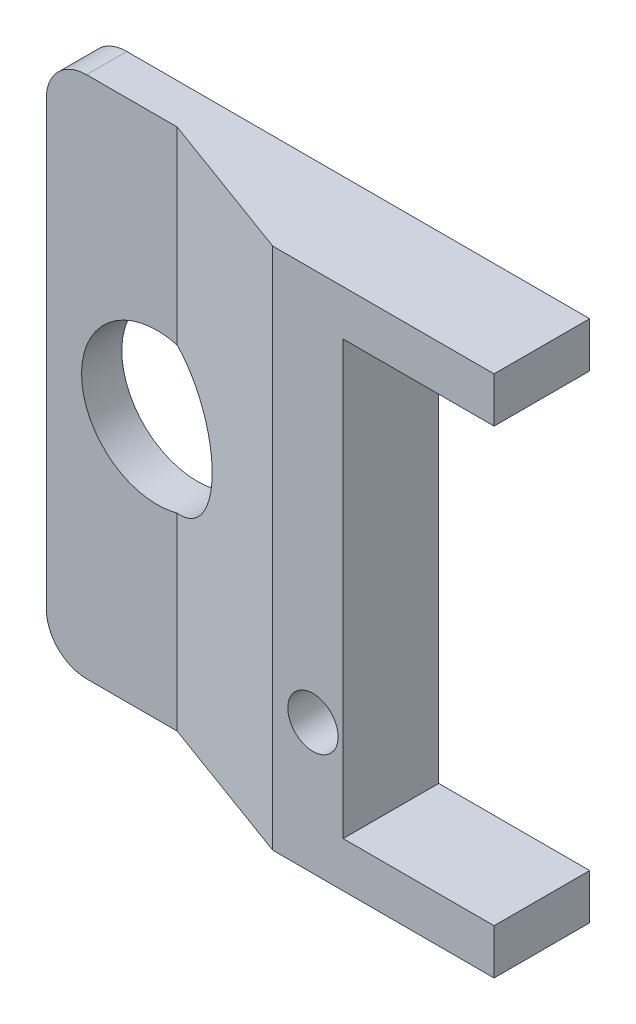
ISO-10303-21;
HEADER;
FILE_DESCRIPTION(('STEP AP214'),'2;1');
FILE_NAME('part.step','',(''),(''),'','','');
FILE_SCHEMA(('AUTOMOTIVE_DESIGN { 1 0 10303 214 1 1 1 1 }'));
ENDSEC;
DATA;
#1=APPLICATION_CONTEXT('core data for automotive mechanical design processes');
#2=APPLICATION_PROTOCOL_DEFINITION('international standard','automotive_design',2000,#1);
#3=PRODUCT_CONTEXT('',#1,'mechanical');
#4=PRODUCT('Part','Part','',(#3));
#5=PRODUCT_RELATED_PRODUCT_CATEGORY('part','',(#4));
#6=PRODUCT_DEFINITION_FORMATION('','',#4);
#7=PRODUCT_DEFINITION_CONTEXT('part definition',#1,'design');
#8=PRODUCT_DEFINITION('design','',#6,#7);
#9=PRODUCT_DEFINITION_SHAPE('','',#8);
#10=(LENGTH_UNIT() NAMED_UNIT(*) SI_UNIT(.MILLI.,.METRE.));
#11=(NAMED_UNIT(*) PLANE_ANGLE_UNIT() SI_UNIT($,.RADIAN.));
#12=(NAMED_UNIT(*) SI_UNIT($,.STERADIAN.) SOLID_ANGLE_UNIT());
#13=UNCERTAINTY_MEASURE_WITH_UNIT(LENGTH_MEASURE(1.E-05),#10,'distance_accuracy_value','');
#14=(GEOMETRIC_REPRESENTATION_CONTEXT(3) GLOBAL_UNCERTAINTY_ASSIGNED_CONTEXT((#13)) GLOBAL_UNIT_ASSIGNED_CONTEXT((#10,
#11,#12)) REPRESENTATION_CONTEXT('',''));
#15=CARTESIAN_POINT('',(0.,0.,0.));
#16=DIRECTION('',(0.,0.,1.));
#17=DIRECTION('',(1.,0.,0.));
#18=AXIS2_PLACEMENT_3D('',#15,#16,#17);
#19=CARTESIAN_POINT('',(39.,-26.,0.));
#20=DIRECTION('',(-1.,0.,0.));
#21=DIRECTION('',(0.,0.,-1.));
#22=AXIS2_PLACEMENT_3D('',#19,#20,#21);
#23=PLANE('',#22);
#24=DIRECTION('',(0.,1.,0.));
#25=VECTOR('',#24,1.);
#26=CARTESIAN_POINT('',(39.,-26.,0.));
#27=LINE('',#26,#25);
#28=CARTESIAN_POINT('',(39.,-26.,0.));
#29=VERTEX_POINT('',#28);
#30=CARTESIAN_POINT('',(39.,-21.5,0.));
#31=VERTEX_POINT('',#30);
#32=EDGE_CURVE('E191',#29,#31,#27,.T.);
#33=ORIENTED_EDGE('',*,*,#32,.T.);
#34=DIRECTION('',(0.,0.,-1.));
#35=VECTOR('',#34,1.);
#36=CARTESIAN_POINT('',(39.,-21.5,9.5));
#37=LINE('',#36,#35);
#38=CARTESIAN_POINT('',(39.,-21.5,9.5));
#39=VERTEX_POINT('',#38);
#40=EDGE_CURVE('E222',#39,#31,#37,.T.);
#41=ORIENTED_EDGE('',*,*,#40,.F.);
#42=DIRECTION('',(0.,1.,0.));
#43=VECTOR('',#42,1.);
#44=CARTESIAN_POINT('',(39.,-26.,9.5));
#45=LINE('',#44,#43);
#46=CARTESIAN_POINT('',(39.,-26.,9.5));
#47=VERTEX_POINT('',#46);
#48=EDGE_CURVE('E140',#47,#39,#45,.T.);
#49=ORIENTED_EDGE('',*,*,#48,.F.);
#50=DIRECTION('',(0.,0.,1.));
#51=VECTOR('',#50,1.);
#52=CARTESIAN_POINT('',(39.,-26.,0.));
#53=LINE('',#52,#51);
#54=EDGE_CURVE('E175',#29,#47,#53,.T.);
#55=ORIENTED_EDGE('',*,*,#54,.F.);
#56=EDGE_LOOP('',(#33,#41,#49,#55));
#57=FACE_BOUND('',#56,.T.);
#58=ADVANCED_FACE('F14',(#57),#23,.F.);
#59=CARTESIAN_POINT('',(39.,21.5,9.5));
#60=VERTEX_POINT('',#59);
#61=CARTESIAN_POINT('',(39.,26.,9.5));
#62=VERTEX_POINT('',#61);
#63=EDGE_CURVE('E134',#60,#62,#45,.T.);
#64=ORIENTED_EDGE('',*,*,#63,.F.);
#65=DIRECTION('',(0.,0.,-1.));
#66=VECTOR('',#65,1.);
#67=CARTESIAN_POINT('',(39.,21.5,9.5));
#68=LINE('',#67,#66);
#69=CARTESIAN_POINT('',(39.,21.5,0.));
#70=VERTEX_POINT('',#69);
#71=EDGE_CURVE('E200',#60,#70,#68,.T.);
#72=ORIENTED_EDGE('',*,*,#71,.T.);
#73=CARTESIAN_POINT('',(39.,26.,0.));
#74=VERTEX_POINT('',#73);
#75=EDGE_CURVE('E190',#70,#74,#27,.T.);
#76=ORIENTED_EDGE('',*,*,#75,.T.);
#77=DIRECTION('',(0.,0.,1.));
#78=VECTOR('',#77,1.);
#79=CARTESIAN_POINT('',(39.,26.,0.));
#80=LINE('',#79,#78);
#81=EDGE_CURVE('E174',#74,#62,#80,.T.);
#82=ORIENTED_EDGE('',*,*,#81,.T.);
#83=EDGE_LOOP('',(#64,#72,#76,#82));
#84=FACE_BOUND('',#83,.T.);
#85=ADVANCED_FACE('F16',(#84),#23,.F.);
#86=CARTESIAN_POINT('',(39.,-26.,9.5));
#87=DIRECTION('',(0.,0.,-1.));
#88=DIRECTION('',(0.,-1.,0.));
#89=AXIS2_PLACEMENT_3D('',#86,#87,#88);
#90=PLANE('',#89);
#91=CARTESIAN_POINT('',(21.,-13.,9.5));
#92=DIRECTION('',(0.,0.,1.));
#93=DIRECTION('',(0.,1.,0.));
#94=AXIS2_PLACEMENT_3D('',#91,#92,#93);
#95=CIRCLE('',#94,2.5);
#96=CARTESIAN_POINT('',(21.,-10.5,9.5));
#97=VERTEX_POINT('',#96);
#98=EDGE_CURVE('E248',#97,#97,#95,.T.);
#99=ORIENTED_EDGE('',*,*,#98,.F.);
#100=EDGE_LOOP('',(#99));
#101=FACE_BOUND('',#100,.T.);
#102=ORIENTED_EDGE('',*,*,#48,.T.);
#103=DIRECTION('',(-1.,0.,0.));
#104=VECTOR('',#103,1.);
#105=CARTESIAN_POINT('',(39.,-21.5,9.5));
#106=LINE('',#105,#104);
#107=CARTESIAN_POINT('',(24.,-21.5,9.5));
#108=VERTEX_POINT('',#107);
#109=EDGE_CURVE('E208',#39,#108,#106,.T.);
#110=ORIENTED_EDGE('',*,*,#109,.T.);
#111=DIRECTION('',(0.,1.,0.));
#112=VECTOR('',#111,1.);
#113=CARTESIAN_POINT('',(24.,-21.5,9.5));
#114=LINE('',#113,#112);
#115=CARTESIAN_POINT('',(24.,21.5,9.5));
#116=VERTEX_POINT('',#115);
#117=EDGE_CURVE('E211',#108,#116,#114,.T.);
#118=ORIENTED_EDGE('',*,*,#117,.T.);
#119=DIRECTION('',(1.,0.,0.));
#120=VECTOR('',#119,1.);
#121=CARTESIAN_POINT('',(24.,21.5,9.5));
#122=LINE('',#121,#120);
#123=EDGE_CURVE('E218',#116,#60,#122,.T.);
#124=ORIENTED_EDGE('',*,*,#123,.T.);
#125=ORIENTED_EDGE('',*,*,#63,.T.);
#126=DIRECTION('',(-1.,0.,0.));
#127=VECTOR('',#126,1.);
#128=CARTESIAN_POINT('',(39.,26.,9.5));
#129=LINE('',#128,#127);
#130=CARTESIAN_POINT('',(17.,26.,9.5));
#131=VERTEX_POINT('',#130);
#132=EDGE_CURVE('E230',#62,#131,#129,.T.);
#133=ORIENTED_EDGE('',*,*,#132,.T.);
#134=DIRECTION('',(0.,1.,0.));
#135=VECTOR('',#134,1.);
#136=CARTESIAN_POINT('',(17.,-26.,9.5));
#137=LINE('',#136,#135);
#138=CARTESIAN_POINT('',(17.,-26.,9.5));
#139=VERTEX_POINT('',#138);
#140=EDGE_CURVE('E131',#139,#131,#137,.T.);
#141=ORIENTED_EDGE('',*,*,#140,.F.);
#142=DIRECTION('',(-1.,0.,0.));
#143=VECTOR('',#142,1.);
#144=CARTESIAN_POINT('',(39.,-26.,9.5));
#145=LINE('',#144,#143);
#146=EDGE_CURVE('E178',#47,#139,#145,.T.);
#147=ORIENTED_EDGE('',*,*,#146,.F.);
#148=EDGE_LOOP('',(#102,#110,#118,#124,#125,#133,#141,#147));
#149=FACE_BOUND('',#148,.T.);
#150=ADVANCED_FACE('F234',(#101,#149),#90,.F.);
#151=CARTESIAN_POINT('',(2.,-26.,4.));
#152=DIRECTION('',(0.344254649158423,0.,-0.938876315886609));
#153=DIRECTION('',(0.938876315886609,0.,0.344254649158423));
#154=AXIS2_PLACEMENT_3D('',#151,#152,#153);
#155=PLANE('',#154);
#156=DIRECTION('',(0.,1.,0.));
#157=VECTOR('',#156,1.);
#158=CARTESIAN_POINT('',(2.,-26.,4.));
#159=LINE('',#158,#157);
#160=CARTESIAN_POINT('',(2.,7.22841614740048,4.));
#161=VERTEX_POINT('',#160);
#162=CARTESIAN_POINT('',(2.,26.,4.));
#163=VERTEX_POINT('',#162);
#164=EDGE_CURVE('E126',#161,#163,#159,.T.);
#165=ORIENTED_EDGE('',*,*,#164,.F.);
#166=CARTESIAN_POINT('',(0.,0.,3.26666666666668));
#167=DIRECTION('',(0.344254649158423,0.,-0.938876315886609));
#168=DIRECTION('',(-0.938876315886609,0.,-0.344254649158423));
#169=AXIS2_PLACEMENT_3D('',#166,#167,#168);
#170=ELLIPSE('',#169,7.98827265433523,7.5);
#171=CARTESIAN_POINT('',(2.,-7.22841614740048,4.));
#172=VERTEX_POINT('',#171);
#173=EDGE_CURVE('E115',#161,#172,#170,.T.);
#174=ORIENTED_EDGE('',*,*,#173,.T.);
#175=CARTESIAN_POINT('',(2.,-26.,4.));
#176=VERTEX_POINT('',#175);
#177=EDGE_CURVE('E124',#176,#172,#159,.T.);
#178=ORIENTED_EDGE('',*,*,#177,.F.);
#179=DIRECTION('',(-0.938876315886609,0.,-0.344254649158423));
#180=VECTOR('',#179,1.);
#181=CARTESIAN_POINT('',(2.,-26.,4.));
#182=LINE('',#181,#180);
#183=EDGE_CURVE('E185',#139,#176,#182,.T.);
#184=ORIENTED_EDGE('',*,*,#183,.F.);
#185=ORIENTED_EDGE('',*,*,#140,.T.);
#186=DIRECTION('',(-0.938876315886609,0.,-0.344254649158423));
#187=VECTOR('',#186,1.);
#188=CARTESIAN_POINT('',(2.,26.,4.));
#189=LINE('',#188,#187);
#190=EDGE_CURVE('E180',#131,#163,#189,.T.);
#191=ORIENTED_EDGE('',*,*,#190,.T.);
#192=EDGE_LOOP('',(#165,#174,#178,#184,#185,#191));
#193=FACE_BOUND('',#192,.T.);
#194=ADVANCED_FACE('F122',(#193),#155,.F.);
#195=CARTESIAN_POINT('',(-11.,-26.,4.));
#196=DIRECTION('',(0.,0.,-1.));
#197=DIRECTION('',(1.,0.,0.));
#198=AXIS2_PLACEMENT_3D('',#195,#196,#197);
#199=PLANE('',#198);
#200=DIRECTION('',(-1.,0.,0.));
#201=VECTOR('',#200,1.);
#202=CARTESIAN_POINT('',(-11.,26.,4.));
#203=LINE('',#202,#201);
#204=CARTESIAN_POINT('',(-7.,26.,4.));
#205=VERTEX_POINT('',#204);
#206=EDGE_CURVE('E155',#163,#205,#203,.T.);
#207=ORIENTED_EDGE('',*,*,#206,.T.);
#208=CARTESIAN_POINT('',(-7.,22.,4.));
#209=DIRECTION('',(0.,0.,-1.));
#210=DIRECTION('',(1.,0.,0.));
#211=AXIS2_PLACEMENT_3D('',#208,#209,#210);
#212=CIRCLE('',#211,4.);
#213=CARTESIAN_POINT('',(-11.,22.,4.));
#214=VERTEX_POINT('',#213);
#215=EDGE_CURVE('E22',#205,#214,#212,.F.);
#216=ORIENTED_EDGE('',*,*,#215,.T.);
#217=DIRECTION('',(0.,1.,0.));
#218=VECTOR('',#217,1.);
#219=CARTESIAN_POINT('',(-11.,-26.,4.));
#220=LINE('',#219,#218);
#221=CARTESIAN_POINT('',(-11.,-22.,4.));
#222=VERTEX_POINT('',#221);
#223=EDGE_CURVE('E136',#222,#214,#220,.T.);
#224=ORIENTED_EDGE('',*,*,#223,.F.);
#225=CARTESIAN_POINT('',(-7.,-22.,4.));
#226=DIRECTION('',(0.,0.,-1.));
#227=DIRECTION('',(1.,0.,0.));
#228=AXIS2_PLACEMENT_3D('',#225,#226,#227);
#229=CIRCLE('',#228,4.);
#230=CARTESIAN_POINT('',(-7.,-26.,4.));
#231=VERTEX_POINT('',#230);
#232=EDGE_CURVE('E29',#222,#231,#229,.F.);
#233=ORIENTED_EDGE('',*,*,#232,.T.);
#234=DIRECTION('',(-1.,0.,0.));
#235=VECTOR('',#234,1.);
#236=CARTESIAN_POINT('',(-11.,-26.,4.));
#237=LINE('',#236,#235);
#238=EDGE_CURVE('E130',#176,#231,#237,.T.);
#239=ORIENTED_EDGE('',*,*,#238,.F.);
#240=ORIENTED_EDGE('',*,*,#177,.T.);
#241=CARTESIAN_POINT('',(0.,0.,4.));
#242=DIRECTION('',(0.,0.,-1.));
#243=DIRECTION('',(1.,0.,0.));
#244=AXIS2_PLACEMENT_3D('',#241,#242,#243);
#245=CIRCLE('',#244,7.5);
#246=EDGE_CURVE('E112',#172,#161,#245,.T.);
#247=ORIENTED_EDGE('',*,*,#246,.T.);
#248=ORIENTED_EDGE('',*,*,#164,.T.);
#249=EDGE_LOOP('',(#207,#216,#224,#233,#239,#240,#247,#248));
#250=FACE_BOUND('',#249,.T.);
#251=ADVANCED_FACE('F129',(#250),#199,.F.);
#252=CARTESIAN_POINT('',(-11.,-26.,0.));
#253=DIRECTION('',(1.,0.,0.));
#254=DIRECTION('',(0.,0.,1.));
#255=AXIS2_PLACEMENT_3D('',#252,#253,#254);
#256=PLANE('',#255);
#257=ORIENTED_EDGE('',*,*,#223,.T.);
#258=DIRECTION('',(0.,0.,-1.));
#259=VECTOR('',#258,1.);
#260=CARTESIAN_POINT('',(-11.,22.,0.));
#261=LINE('',#260,#259);
#262=CARTESIAN_POINT('',(-11.,22.,0.));
#263=VERTEX_POINT('',#262);
#264=EDGE_CURVE('E145',#214,#263,#261,.T.);
#265=ORIENTED_EDGE('',*,*,#264,.T.);
#266=DIRECTION('',(0.,1.,0.));
#267=VECTOR('',#266,1.);
#268=CARTESIAN_POINT('',(-11.,-26.,0.));
#269=LINE('',#268,#267);
#270=CARTESIAN_POINT('',(-11.,-22.,0.));
#271=VERTEX_POINT('',#270);
#272=EDGE_CURVE('E163',#271,#263,#269,.T.);
#273=ORIENTED_EDGE('',*,*,#272,.F.);
#274=DIRECTION('',(0.,0.,-1.));
#275=VECTOR('',#274,1.);
#276=CARTESIAN_POINT('',(-11.,-22.,4.));
#277=LINE('',#276,#275);
#278=EDGE_CURVE('E143',#271,#222,#277,.F.);
#279=ORIENTED_EDGE('',*,*,#278,.T.);
#280=EDGE_LOOP('',(#257,#265,#273,#279));
#281=FACE_BOUND('',#280,.T.);
#282=ADVANCED_FACE('F159',(#281),#256,.F.);
#283=CARTESIAN_POINT('',(39.,-26.,0.));
#284=DIRECTION('',(0.,0.,1.));
#285=DIRECTION('',(0.,1.,0.));
#286=AXIS2_PLACEMENT_3D('',#283,#284,#285);
#287=PLANE('',#286);
#288=CARTESIAN_POINT('',(21.,-13.,0.));
#289=DIRECTION('',(0.,0.,1.));
#290=DIRECTION('',(0.,1.,0.));
#291=AXIS2_PLACEMENT_3D('',#288,#289,#290);
#292=CIRCLE('',#291,2.5);
#293=CARTESIAN_POINT('',(21.,-10.5,0.));
#294=VERTEX_POINT('',#293);
#295=EDGE_CURVE('E245',#294,#294,#292,.T.);
#296=ORIENTED_EDGE('',*,*,#295,.T.);
#297=EDGE_LOOP('',(#296));
#298=FACE_BOUND('',#297,.T.);
#299=CARTESIAN_POINT('',(0.,0.,0.));
#300=DIRECTION('',(0.,0.,-1.));
#301=DIRECTION('',(0.,-1.,0.));
#302=AXIS2_PLACEMENT_3D('',#299,#300,#301);
#303=CIRCLE('',#302,7.5);
#304=CARTESIAN_POINT('',(0.,-7.5,0.));
#305=VERTEX_POINT('',#304);
#306=EDGE_CURVE('E118',#305,#305,#303,.T.);
#307=ORIENTED_EDGE('',*,*,#306,.F.);
#308=EDGE_LOOP('',(#307));
#309=FACE_BOUND('',#308,.T.);
#310=ORIENTED_EDGE('',*,*,#272,.T.);
#311=CARTESIAN_POINT('',(-7.,22.,0.));
#312=DIRECTION('',(0.,0.,1.));
#313=DIRECTION('',(0.,1.,0.));
#314=AXIS2_PLACEMENT_3D('',#311,#312,#313);
#315=CIRCLE('',#314,4.);
#316=CARTESIAN_POINT('',(-7.,26.,0.));
#317=VERTEX_POINT('',#316);
#318=EDGE_CURVE('E150',#263,#317,#315,.F.);
#319=ORIENTED_EDGE('',*,*,#318,.T.);
#320=DIRECTION('',(1.,0.,0.));
#321=VECTOR('',#320,1.);
#322=CARTESIAN_POINT('',(39.,26.,0.));
#323=LINE('',#322,#321);
#324=EDGE_CURVE('E168',#317,#74,#323,.T.);
#325=ORIENTED_EDGE('',*,*,#324,.T.);
#326=ORIENTED_EDGE('',*,*,#75,.F.);
#327=DIRECTION('',(1.,0.,0.));
#328=VECTOR('',#327,1.);
#329=CARTESIAN_POINT('',(24.,21.5,0.));
#330=LINE('',#329,#328);
#331=CARTESIAN_POINT('',(24.,21.5,0.));
#332=VERTEX_POINT('',#331);
#333=EDGE_CURVE('E203',#332,#70,#330,.T.);
#334=ORIENTED_EDGE('',*,*,#333,.F.);
#335=DIRECTION('',(0.,1.,0.));
#336=VECTOR('',#335,1.);
#337=CARTESIAN_POINT('',(24.,-21.5,0.));
#338=LINE('',#337,#336);
#339=CARTESIAN_POINT('',(24.,-21.5,0.));
#340=VERTEX_POINT('',#339);
#341=EDGE_CURVE('E206',#340,#332,#338,.T.);
#342=ORIENTED_EDGE('',*,*,#341,.F.);
#343=DIRECTION('',(-1.,0.,0.));
#344=VECTOR('',#343,1.);
#345=CARTESIAN_POINT('',(39.,-21.5,0.));
#346=LINE('',#345,#344);
#347=EDGE_CURVE('E127',#31,#340,#346,.T.);
#348=ORIENTED_EDGE('',*,*,#347,.F.);
#349=ORIENTED_EDGE('',*,*,#32,.F.);
#350=DIRECTION('',(1.,0.,0.));
#351=VECTOR('',#350,1.);
#352=CARTESIAN_POINT('',(39.,-26.,0.));
#353=LINE('',#352,#351);
#354=CARTESIAN_POINT('',(-7.,-26.,0.));
#355=VERTEX_POINT('',#354);
#356=EDGE_CURVE('E188',#355,#29,#353,.T.);
#357=ORIENTED_EDGE('',*,*,#356,.F.);
#358=CARTESIAN_POINT('',(-7.,-22.,0.));
#359=DIRECTION('',(0.,0.,1.));
#360=DIRECTION('',(0.,1.,0.));
#361=AXIS2_PLACEMENT_3D('',#358,#359,#360);
#362=CIRCLE('',#361,4.);
#363=EDGE_CURVE('E148',#355,#271,#362,.F.);
#364=ORIENTED_EDGE('',*,*,#363,.T.);
#365=EDGE_LOOP('',(#310,#319,#325,#326,#334,#342,#348,#349,#357,#364));
#366=FACE_BOUND('',#365,.T.);
#367=ADVANCED_FACE('F166',(#298,#309,#366),#287,.F.);
#368=CARTESIAN_POINT('',(39.,-26.,9.5));
#369=DIRECTION('',(0.,-1.,0.));
#370=DIRECTION('',(0.,0.,1.));
#371=AXIS2_PLACEMENT_3D('',#368,#369,#370);
#372=PLANE('',#371);
#373=ORIENTED_EDGE('',*,*,#238,.T.);
#374=DIRECTION('',(0.,0.,-1.));
#375=VECTOR('',#374,1.);
#376=CARTESIAN_POINT('',(-7.,-26.,0.));
#377=LINE('',#376,#375);
#378=EDGE_CURVE('E9',#231,#355,#377,.T.);
#379=ORIENTED_EDGE('',*,*,#378,.T.);
#380=ORIENTED_EDGE('',*,*,#356,.T.);
#381=ORIENTED_EDGE('',*,*,#54,.T.);
#382=ORIENTED_EDGE('',*,*,#146,.T.);
#383=ORIENTED_EDGE('',*,*,#183,.T.);
#384=EDGE_LOOP('',(#373,#379,#380,#381,#382,#383));
#385=FACE_BOUND('',#384,.T.);
#386=ADVANCED_FACE('F309',(#385),#372,.T.);
#387=CARTESIAN_POINT('',(39.,26.,9.5));
#388=DIRECTION('',(0.,-1.,0.));
#389=DIRECTION('',(0.,0.,1.));
#390=AXIS2_PLACEMENT_3D('',#387,#388,#389);
#391=PLANE('',#390);
#392=ORIENTED_EDGE('',*,*,#324,.F.);
#393=DIRECTION('',(0.,0.,-1.));
#394=VECTOR('',#393,1.);
#395=CARTESIAN_POINT('',(-7.,26.,9.5));
#396=LINE('',#395,#394);
#397=EDGE_CURVE('E37',#317,#205,#396,.F.);
#398=ORIENTED_EDGE('',*,*,#397,.T.);
#399=ORIENTED_EDGE('',*,*,#206,.F.);
#400=ORIENTED_EDGE('',*,*,#190,.F.);
#401=ORIENTED_EDGE('',*,*,#132,.F.);
#402=ORIENTED_EDGE('',*,*,#81,.F.);
#403=EDGE_LOOP('',(#392,#398,#399,#400,#401,#402));
#404=FACE_BOUND('',#403,.T.);
#405=ADVANCED_FACE('F171',(#404),#391,.F.);
#406=CARTESIAN_POINT('',(39.,-21.5,9.5));
#407=DIRECTION('',(0.,-1.,0.));
#408=DIRECTION('',(0.,0.,1.));
#409=AXIS2_PLACEMENT_3D('',#406,#407,#408);
#410=PLANE('',#409);
#411=ORIENTED_EDGE('',*,*,#347,.T.);
#412=DIRECTION('',(0.,0.,-1.));
#413=VECTOR('',#412,1.);
#414=CARTESIAN_POINT('',(24.,-21.5,9.5));
#415=LINE('',#414,#413);
#416=EDGE_CURVE('E221',#108,#340,#415,.T.);
#417=ORIENTED_EDGE('',*,*,#416,.F.);
#418=ORIENTED_EDGE('',*,*,#109,.F.);
#419=ORIENTED_EDGE('',*,*,#40,.T.);
#420=EDGE_LOOP('',(#411,#417,#418,#419));
#421=FACE_BOUND('',#420,.T.);
#422=ADVANCED_FACE('F241',(#421),#410,.F.);
#423=CARTESIAN_POINT('',(24.,21.5,9.5));
#424=DIRECTION('',(0.,1.,0.));
#425=DIRECTION('',(0.,0.,-1.));
#426=AXIS2_PLACEMENT_3D('',#423,#424,#425);
#427=PLANE('',#426);
#428=ORIENTED_EDGE('',*,*,#333,.T.);
#429=ORIENTED_EDGE('',*,*,#71,.F.);
#430=ORIENTED_EDGE('',*,*,#123,.F.);
#431=DIRECTION('',(0.,0.,-1.));
#432=VECTOR('',#431,1.);
#433=CARTESIAN_POINT('',(24.,21.5,9.5));
#434=LINE('',#433,#432);
#435=EDGE_CURVE('E225',#116,#332,#434,.T.);
#436=ORIENTED_EDGE('',*,*,#435,.T.);
#437=EDGE_LOOP('',(#428,#429,#430,#436));
#438=FACE_BOUND('',#437,.T.);
#439=ADVANCED_FACE('F237',(#438),#427,.F.);
#440=CARTESIAN_POINT('',(24.,-21.5,9.5));
#441=DIRECTION('',(-1.,0.,0.));
#442=DIRECTION('',(0.,1.,0.));
#443=AXIS2_PLACEMENT_3D('',#440,#441,#442);
#444=PLANE('',#443);
#445=ORIENTED_EDGE('',*,*,#341,.T.);
#446=ORIENTED_EDGE('',*,*,#435,.F.);
#447=ORIENTED_EDGE('',*,*,#117,.F.);
#448=ORIENTED_EDGE('',*,*,#416,.T.);
#449=EDGE_LOOP('',(#445,#446,#447,#448));
#450=FACE_BOUND('',#449,.T.);
#451=ADVANCED_FACE('F239',(#450),#444,.F.);
#452=CARTESIAN_POINT('',(0.,0.,52.));
#453=DIRECTION('',(0.,0.,-1.));
#454=DIRECTION('',(0.,-1.,0.));
#455=AXIS2_PLACEMENT_3D('',#452,#453,#454);
#456=CYLINDRICAL_SURFACE('',#455,7.5);
#457=ORIENTED_EDGE('',*,*,#306,.T.);
#458=EDGE_LOOP('',(#457));
#459=FACE_BOUND('',#458,.T.);
#460=ORIENTED_EDGE('',*,*,#246,.F.);
#461=ORIENTED_EDGE('',*,*,#173,.F.);
#462=EDGE_LOOP('',(#460,#461));
#463=FACE_BOUND('',#462,.T.);
#464=ADVANCED_FACE('F114',(#459,#463),#456,.F.);
#465=CARTESIAN_POINT('',(21.,-13.,0.));
#466=DIRECTION('',(0.,0.,1.));
#467=DIRECTION('',(0.,1.,0.));
#468=AXIS2_PLACEMENT_3D('',#465,#466,#467);
#469=CYLINDRICAL_SURFACE('',#468,2.5);
#470=ORIENTED_EDGE('',*,*,#295,.F.);
#471=EDGE_LOOP('',(#470));
#472=FACE_BOUND('',#471,.T.);
#473=ORIENTED_EDGE('',*,*,#98,.T.);
#474=EDGE_LOOP('',(#473));
#475=FACE_BOUND('',#474,.T.);
#476=ADVANCED_FACE('F252',(#472,#475),#469,.F.);
#477=CARTESIAN_POINT('',(-7.,22.,0.));
#478=DIRECTION('',(0.,0.,-1.));
#479=DIRECTION('',(0.,-1.,0.));
#480=AXIS2_PLACEMENT_3D('',#477,#478,#479);
#481=CYLINDRICAL_SURFACE('',#480,4.);
#482=ORIENTED_EDGE('',*,*,#215,.F.);
#483=ORIENTED_EDGE('',*,*,#397,.F.);
#484=ORIENTED_EDGE('',*,*,#318,.F.);
#485=ORIENTED_EDGE('',*,*,#264,.F.);
#486=EDGE_LOOP('',(#482,#483,#484,#485));
#487=FACE_BOUND('',#486,.T.);
#488=ADVANCED_FACE('F164',(#487),#481,.T.);
#489=CARTESIAN_POINT('',(-7.,-22.,9.5));
#490=DIRECTION('',(0.,0.,1.));
#491=DIRECTION('',(0.,1.,0.));
#492=AXIS2_PLACEMENT_3D('',#489,#490,#491);
#493=CYLINDRICAL_SURFACE('',#492,4.);
#494=ORIENTED_EDGE('',*,*,#232,.F.);
#495=ORIENTED_EDGE('',*,*,#278,.F.);
#496=ORIENTED_EDGE('',*,*,#363,.F.);
#497=ORIENTED_EDGE('',*,*,#378,.F.);
#498=EDGE_LOOP('',(#494,#495,#496,#497));
#499=FACE_BOUND('',#498,.T.);
#500=ADVANCED_FACE('F370',(#499),#493,.T.);
#501=CLOSED_SHELL('',(#58,#85,#150,#194,#251,#282,#367,#386,#405,#422,#439,#451,#464,#476,#488,#500));
#502=MANIFOLD_SOLID_BREP('B1',#501);
#503=ADVANCED_BREP_SHAPE_REPRESENTATION('',(#18,#502),#14);
#504=SHAPE_DEFINITION_REPRESENTATION(#9,#503);
ENDSEC;
END-ISO-10303-21;
